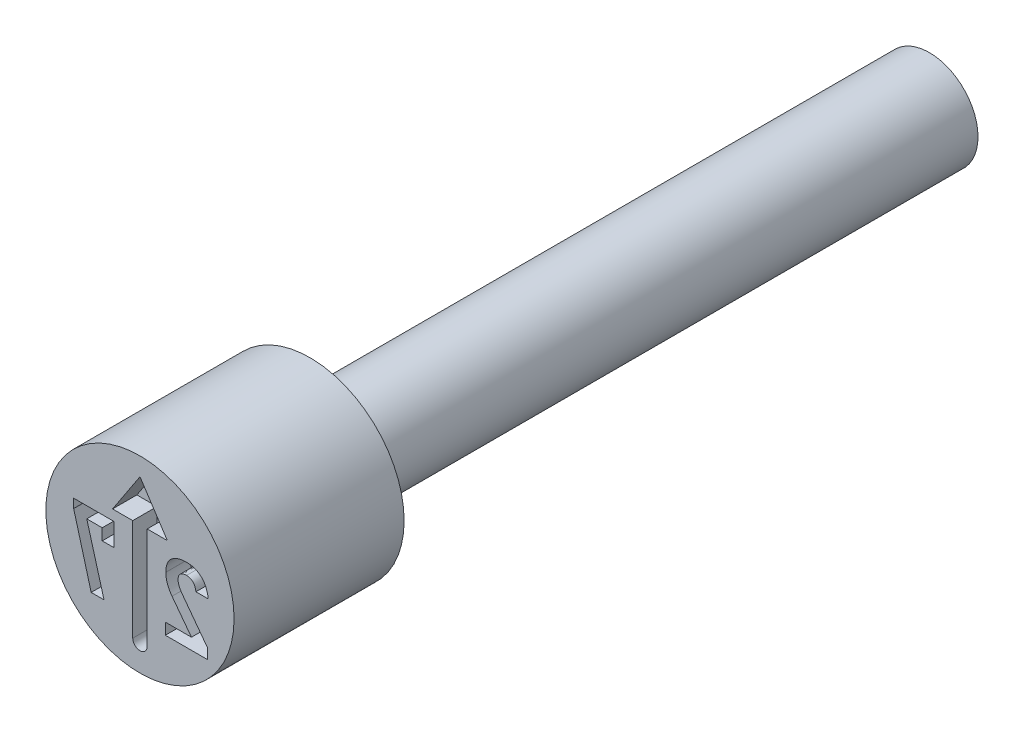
from build123d import *

# Parameters (mm, degrees)
CUT_EXTRUDE4_DEPTH = 0.4
CUT_EXTRUDE5_DEPTH = 0.4


with BuildPart() as part:
    # Sketch2 → Revolve1 (revolve)
    with BuildSketch(Plane(origin=(0, 0, 0), x_dir=(0, 0, -1), z_dir=(1, 0, 0)), mode=Mode.PRIVATE) as revolve1_sk:
        Polygon((0, 1.55), (0, 0), (13, 0), (13, 0.8), (2.8, 0.8), (2.8, 1.55), align=None)
    revolve(revolve1_sk.sketch.rotate(Axis((0, 0, -0.403888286), (0, 0, -1)), 90), axis=Axis((0, 0, -0.403888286), (0, 0, -1)))

    # Sketch3 → Cut-Extrude4 (cut)
    with BuildSketch(Plane.XY):
        with BuildLine():
            Line((0.119045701, 0.566469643), (0.119045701, -1.110101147))
            ThreePointArc((0.119045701, -1.110101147), (0, -1.229146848), (-0.119045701, -1.110101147))
            Line((-0.119045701, -1.110101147), (-0.119045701, 0.566469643))
            Line((-0.119045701, 0.566469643), (-0.451198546, 0.566469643))
            Line((-0.451198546, 0.566469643), (0, 1.251322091))
            Line((0, 1.251322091), (0.451198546, 0.566469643))
            Line((0.451198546, 0.566469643), (0.119045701, 0.566469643))
        make_face()
    extrude(amount=-CUT_EXTRUDE4_DEPTH, mode=Mode.SUBTRACT)

    # Sketch4 → Cut-Extrude5 (cut)
    with BuildSketch(Plane.XY):
        with BuildLine():
            Line((1.108650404, -0.8), (1.108650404, -0.626866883))
            Line((1.108650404, -0.626866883), (0.695176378, -0.072646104))
            add(Edge.make_bspline(
                [(0.695176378, -0.072646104), (0.690059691, -0.065561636), (0.679970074, -0.051591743), (0.66646868, -0.029871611), (0.655095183, -0.007644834), (0.645287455, 0.014677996), (0.637605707, 0.036837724), (0.631801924, 0.058365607), (0.628600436, 0.079206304), (0.628012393, 0.092847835), (0.627725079, 0.099512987)],
                knots=[0, 0, 0, 0, 1.116221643, 2.201082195, 3.263105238, 4.303340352, 5.313368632, 6.256511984, 7.148144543, 8, 8, 8, 8], degree=3))
            Line((0.627725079, 0.099512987), (0.627725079, 0.101217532))
            add(Edge.make_bspline(
                [(0.627725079, 0.101217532), (0.628053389, 0.110847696), (0.628681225, 0.129263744), (0.635963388, 0.155042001), (0.647538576, 0.177472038), (0.664043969, 0.196031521), (0.684579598, 0.210800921), (0.709114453, 0.221457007), (0.7375167, 0.227328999), (0.757649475, 0.228143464), (0.768228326, 0.228571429)],
                knots=[0, 0, 0, 0, 1.070617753, 2.047374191, 2.957911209, 3.861726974, 4.788257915, 5.756429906, 6.821106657, 8, 8, 8, 8], degree=3))
            add(Edge.make_bspline(
                [(0.768228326, 0.228571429), (0.778355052, 0.228193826), (0.797963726, 0.227462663), (0.825796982, 0.219201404), (0.851030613, 0.206508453), (0.872773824, 0.188167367), (0.891048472, 0.165305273), (0.905535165, 0.138100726), (0.915677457, 0.106476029), (0.919271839, 0.083831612), (0.921150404, 0.071996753)],
                knots=[0, 0, 0, 0, 0.999891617, 1.936119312, 2.849186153, 3.779495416, 4.728470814, 5.731748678, 6.81452301, 8, 8, 8, 8], degree=3))
            Line((0.921150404, 0.071996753), (1.123260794, 0.071266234))
            add(Edge.make_bspline(
                [(1.123260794, 0.071266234), (1.121703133, 0.085344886), (1.118662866, 0.11139798), (1.110393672, 0.14894139), (1.100275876, 0.184247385), (1.087600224, 0.217269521), (1.072473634, 0.247960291), (1.055233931, 0.276546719), (1.035020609, 0.30234201), (1.012964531, 0.326116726), (0.988500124, 0.347012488), (0.9623382, 0.365383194), (0.934484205, 0.381067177), (0.904847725, 0.393787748), (0.873474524, 0.403470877), (0.840489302, 0.41057553), (0.805752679, 0.414719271), (0.782038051, 0.415292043), (0.769932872, 0.415584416)],
                knots=[0, 0, 0, 0, 1.176458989, 2.296231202, 3.362707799, 4.39127888, 5.389699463, 6.356664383, 7.309489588, 8.255125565, 9.192870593, 10.121896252, 11.051411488, 11.987780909, 12.941242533, 13.922967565, 14.939774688, 16, 16, 16, 16], degree=3))
            add(Edge.make_bspline(
                [(0.769932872, 0.415584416), (0.756529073, 0.415389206), (0.730472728, 0.415009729), (0.6926359, 0.4109719), (0.657096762, 0.404770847), (0.623885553, 0.395815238), (0.593068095, 0.384102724), (0.564615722, 0.369880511), (0.538342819, 0.353356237), (0.514638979, 0.333969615), (0.493470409, 0.312341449), (0.474950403, 0.28855151), (0.459663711, 0.26239411), (0.446516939, 0.234396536), (0.437000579, 0.203950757), (0.429837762, 0.171627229), (0.425738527, 0.137117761), (0.425174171, 0.113403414), (0.42488417, 0.101217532)],
                knots=[0, 0, 0, 0, 1.211483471, 2.355066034, 3.436186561, 4.470562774, 5.460097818, 6.411901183, 7.342329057, 8.260432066, 9.17382984, 10.073682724, 10.9786387, 11.907937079, 12.864144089, 13.855989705, 14.898276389, 16, 16, 16, 16], degree=3))
            add(Edge.make_bspline(
                [(0.42488417, 0.101217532), (0.425203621, 0.088210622), (0.425845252, 0.063552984), (0.431394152, 0.026453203), (0.439406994, -0.011031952), (0.451586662, -0.0483617), (0.466255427, -0.085323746), (0.484140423, -0.121075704), (0.504550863, -0.155723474), (0.520395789, -0.177397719), (0.52837443, -0.188311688)],
                knots=[0, 0, 0, 0, 0.943703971, 1.895468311, 2.880041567, 3.888955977, 4.911454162, 5.936103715, 6.960734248, 8, 8, 8, 8], degree=3))
            Line((0.52837443, -0.188311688), (0.848098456, -0.612987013))
            Line((0.848098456, -0.612987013), (0.418309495, -0.612987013))
            Line((0.418309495, -0.612987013), (0.418309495, -0.8))
            Line((0.418309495, -0.8), (1.108650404, -0.8))
        make_face()
        Polygon((-1.091684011, 0.4), (-1.091684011, 0.251461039), (-0.803128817, -0.8), (-0.592008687, -0.8), (-0.876180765, 0.212987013), (-0.621472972, 0.212987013), (-0.621472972, 0.025974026), (-0.425206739, 0.025974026), (-0.425206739, 0.4), align=None)
    extrude(amount=-CUT_EXTRUDE5_DEPTH, mode=Mode.SUBTRACT)


solid = part.part
